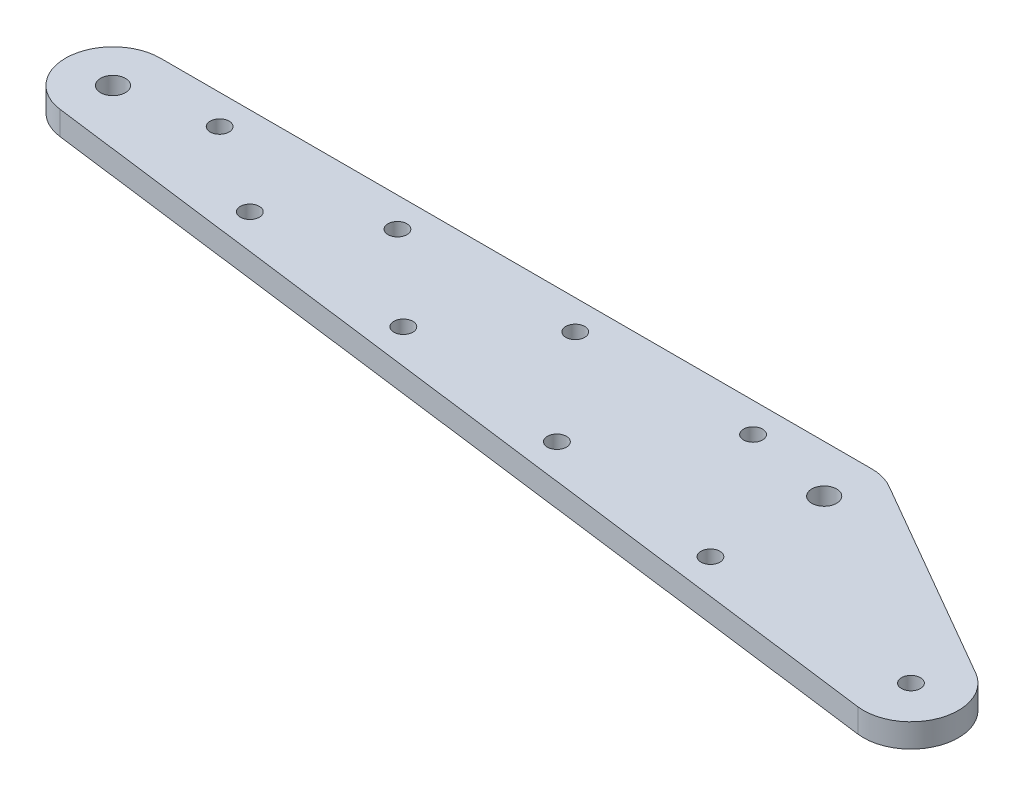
from build123d import *

# Parameters (mm, degrees)
SKETCH_1_R          = 2.1
SKETCH_1_R_2        = 1.6
EXTRUDE_1_DEPTH     = 4
SKETCH_2_R          = 1.6
CUT_EXTRUDE_1_DEPTH = 166.082101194


with BuildPart() as part:
    # Sketch 1 → Extrude 1 (new body)
    with BuildSketch(Plane(origin=(0, 0, 0), x_dir=(1, 0, 0), z_dir=(0, 1, 0))):
        with BuildLine():
            Line((153.614907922, -27.933920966), (-1.02610823, -7.933920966))
            ThreePointArc((-1.02610823, -7.933920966), (-7.98346315, 0.514116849), (0, 8))
            Line((0, 8), (120, 8))
            ThreePointArc((120, 8), (122.070552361, 7.72740661), (124, 6.92820323))
            Line((124, 6.92820323), (158.641016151, -13.07179677))
            ThreePointArc((158.641016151, -13.07179677), (162.219386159, -22.562871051), (153.614907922, -27.933920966))
        make_face()
        with Locations(Location((0, 0, 0), (0, 0, 270))):
            Circle(SKETCH_1_R, mode=Mode.SUBTRACT)
        with Locations(Location((154.641016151, -20, 0), (0, 0, 270))):
            Circle(SKETCH_1_R_2, mode=Mode.SUBTRACT)
        with Locations(Location((120, 0, 0), (0, 0, 270))):
            Circle(SKETCH_1_R, mode=Mode.SUBTRACT)
    extrude(amount=EXTRUDE_1_DEPTH)

    # Sketch 2 → Cut-Extrude 1 (cut, through all)
    with BuildSketch(Plane(origin=(0, 4, 0), x_dir=(1, 0, 0), z_dir=(0, 1, 0))):
        with Locations(Location((15, 3, 0), (0, 0, 270))):
            Circle(SKETCH_2_R)
        with Locations(Location((45, 3, 0), (0, 0, 270))):
            Circle(SKETCH_2_R)
        with Locations(Location((75, 3, 0), (0, 0, 270))):
            Circle(SKETCH_2_R)
        with Locations(Location((105, 3, 0), (0, 0, 270))):
            Circle(SKETCH_2_R)
        with Locations(Location((30, -6.90493983, 0), (0, 0, 270))):
            Circle(SKETCH_2_R)
        with Locations(Location((59.752203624, -10.752845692, 0), (0, 0, 270))):
            Circle(SKETCH_2_R)
        with Locations(Location((89.504407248, -14.600751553, 0), (0, 0, 270))):
            Circle(SKETCH_2_R)
        with Locations(Location((119.256610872, -18.448657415, 0), (0, 0, 270))):
            Circle(SKETCH_2_R)
    extrude(amount=-CUT_EXTRUDE_1_DEPTH, mode=Mode.SUBTRACT)


solid = part.part
